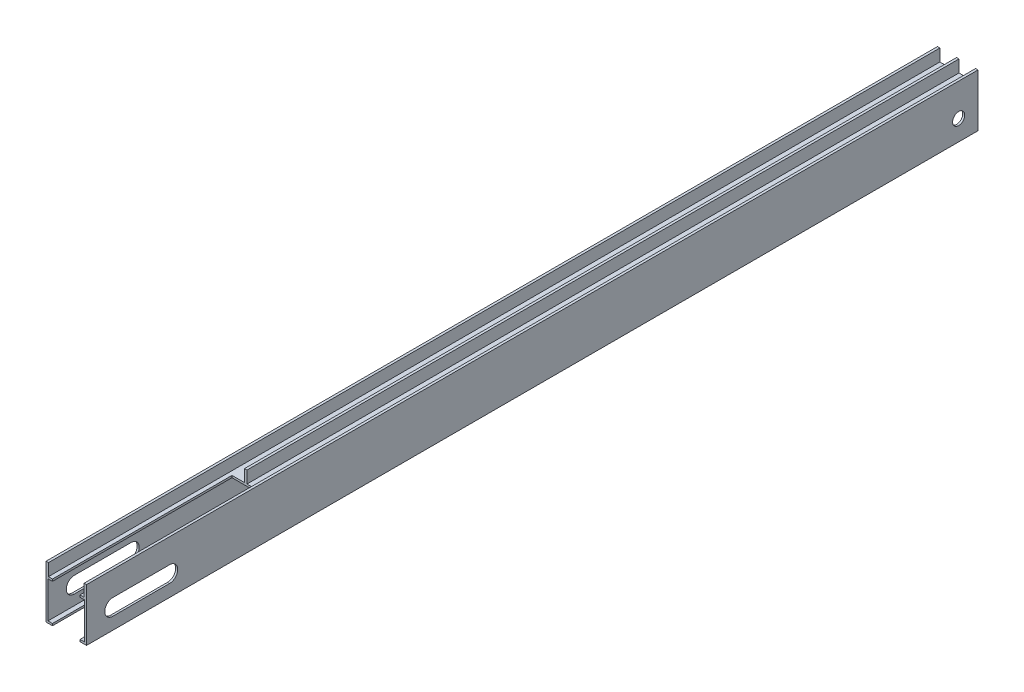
ISO-10303-21;
HEADER;
FILE_DESCRIPTION(('STEP AP214'),'2;1');
FILE_NAME('part.step','',(''),(''),'','','');
FILE_SCHEMA(('AUTOMOTIVE_DESIGN { 1 0 10303 214 1 1 1 1 }'));
ENDSEC;
DATA;
#1=APPLICATION_CONTEXT('core data for automotive mechanical design processes');
#2=APPLICATION_PROTOCOL_DEFINITION('international standard','automotive_design',2000,#1);
#3=PRODUCT_CONTEXT('',#1,'mechanical');
#4=PRODUCT('Part','Part','',(#3));
#5=PRODUCT_RELATED_PRODUCT_CATEGORY('part','',(#4));
#6=PRODUCT_DEFINITION_FORMATION('','',#4);
#7=PRODUCT_DEFINITION_CONTEXT('part definition',#1,'design');
#8=PRODUCT_DEFINITION('design','',#6,#7);
#9=PRODUCT_DEFINITION_SHAPE('','',#8);
#10=(LENGTH_UNIT() NAMED_UNIT(*) SI_UNIT(.MILLI.,.METRE.));
#11=(NAMED_UNIT(*) PLANE_ANGLE_UNIT() SI_UNIT($,.RADIAN.));
#12=(NAMED_UNIT(*) SI_UNIT($,.STERADIAN.) SOLID_ANGLE_UNIT());
#13=UNCERTAINTY_MEASURE_WITH_UNIT(LENGTH_MEASURE(1.E-05),#10,'distance_accuracy_value','');
#14=(GEOMETRIC_REPRESENTATION_CONTEXT(3) GLOBAL_UNCERTAINTY_ASSIGNED_CONTEXT((#13)) GLOBAL_UNIT_ASSIGNED_CONTEXT((#10,
#11,#12)) REPRESENTATION_CONTEXT('',''));
#15=CARTESIAN_POINT('',(0.,0.,0.));
#16=DIRECTION('',(0.,0.,1.));
#17=DIRECTION('',(1.,0.,0.));
#18=AXIS2_PLACEMENT_3D('',#15,#16,#17);
#19=CARTESIAN_POINT('',(50.,50.,2200.));
#20=DIRECTION('',(0.,-1.,0.));
#21=DIRECTION('',(1.,0.,0.));
#22=AXIS2_PLACEMENT_3D('',#19,#20,#21);
#23=PLANE('',#22);
#24=DIRECTION('',(-1.,0.,0.));
#25=VECTOR('',#24,1.);
#26=CARTESIAN_POINT('',(50.,50.,1757.));
#27=LINE('',#26,#25);
#28=CARTESIAN_POINT('',(-3.,50.,1757.));
#29=VERTEX_POINT('',#28);
#30=CARTESIAN_POINT('',(-34.,50.,1757.));
#31=VERTEX_POINT('',#30);
#32=EDGE_CURVE('E291',#29,#31,#27,.T.);
#33=ORIENTED_EDGE('',*,*,#32,.F.);
#34=DIRECTION('',(0.,0.,1.));
#35=VECTOR('',#34,1.);
#36=CARTESIAN_POINT('',(-3.,50.,-30.5941170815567));
#37=LINE('',#36,#35);
#38=CARTESIAN_POINT('',(-3.,50.,0.));
#39=VERTEX_POINT('',#38);
#40=EDGE_CURVE('E284',#39,#29,#37,.T.);
#41=ORIENTED_EDGE('',*,*,#40,.F.);
#42=DIRECTION('',(-1.,0.,0.));
#43=VECTOR('',#42,1.);
#44=CARTESIAN_POINT('',(50.,50.,0.));
#45=LINE('',#44,#43);
#46=CARTESIAN_POINT('',(-44.,50.,0.));
#47=VERTEX_POINT('',#46);
#48=EDGE_CURVE('E43',#39,#47,#45,.T.);
#49=ORIENTED_EDGE('',*,*,#48,.T.);
#50=DIRECTION('',(0.,0.,-1.));
#51=VECTOR('',#50,1.);
#52=CARTESIAN_POINT('',(-44.,50.,2200.));
#53=LINE('',#52,#51);
#54=CARTESIAN_POINT('',(-44.,50.,2200.));
#55=VERTEX_POINT('',#54);
#56=EDGE_CURVE('E398',#55,#47,#53,.T.);
#57=ORIENTED_EDGE('',*,*,#56,.F.);
#58=DIRECTION('',(-1.,0.,0.));
#59=VECTOR('',#58,1.);
#60=CARTESIAN_POINT('',(50.,50.,2200.));
#61=LINE('',#60,#59);
#62=CARTESIAN_POINT('',(-34.,50.,2200.));
#63=VERTEX_POINT('',#62);
#64=EDGE_CURVE('E447',#63,#55,#61,.T.);
#65=ORIENTED_EDGE('',*,*,#64,.F.);
#66=DIRECTION('',(0.,0.,-1.));
#67=VECTOR('',#66,1.);
#68=CARTESIAN_POINT('',(-34.,50.,2200.));
#69=LINE('',#68,#67);
#70=EDGE_CURVE('E309',#63,#31,#69,.T.);
#71=ORIENTED_EDGE('',*,*,#70,.T.);
#72=EDGE_LOOP('',(#33,#41,#49,#57,#65,#71));
#73=FACE_BOUND('',#72,.T.);
#74=ADVANCED_FACE('F39',(#73),#23,.F.);
#75=CARTESIAN_POINT('',(0.,0.,2200.));
#76=DIRECTION('',(0.,0.,1.));
#77=DIRECTION('',(1.,0.,0.));
#78=AXIS2_PLACEMENT_3D('',#75,#76,#77);
#79=PLANE('',#78);
#80=DIRECTION('',(0.,-1.,0.));
#81=VECTOR('',#80,1.);
#82=CARTESIAN_POINT('',(-34.,59.3201922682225,2200.));
#83=LINE('',#82,#81);
#84=CARTESIAN_POINT('',(-34.,45.,2200.));
#85=VERTEX_POINT('',#84);
#86=EDGE_CURVE('E582',#63,#85,#83,.T.);
#87=ORIENTED_EDGE('',*,*,#86,.F.);
#88=ORIENTED_EDGE('',*,*,#64,.T.);
#89=DIRECTION('',(0.,-1.,0.));
#90=VECTOR('',#89,1.);
#91=CARTESIAN_POINT('',(-44.,50.,2200.));
#92=LINE('',#91,#90);
#93=CARTESIAN_POINT('',(-44.,80.,2200.));
#94=VERTEX_POINT('',#93);
#95=EDGE_CURVE('E389',#94,#55,#92,.T.);
#96=ORIENTED_EDGE('',*,*,#95,.F.);
#97=DIRECTION('',(1.,0.,0.));
#98=VECTOR('',#97,1.);
#99=CARTESIAN_POINT('',(-44.,80.,2200.));
#100=LINE('',#99,#98);
#101=CARTESIAN_POINT('',(-50.,80.,2200.));
#102=VERTEX_POINT('',#101);
#103=EDGE_CURVE('E386',#102,#94,#100,.T.);
#104=ORIENTED_EDGE('',*,*,#103,.F.);
#105=DIRECTION('',(0.,-1.,0.));
#106=VECTOR('',#105,1.);
#107=CARTESIAN_POINT('',(-50.,-50.,2200.));
#108=LINE('',#107,#106);
#109=CARTESIAN_POINT('',(-50.,-50.,2200.));
#110=VERTEX_POINT('',#109);
#111=EDGE_CURVE('E514',#102,#110,#108,.T.);
#112=ORIENTED_EDGE('',*,*,#111,.T.);
#113=DIRECTION('',(1.,0.,0.));
#114=VECTOR('',#113,1.);
#115=CARTESIAN_POINT('',(50.,-50.,2200.));
#116=LINE('',#115,#114);
#117=CARTESIAN_POINT('',(-34.,-50.,2200.));
#118=VERTEX_POINT('',#117);
#119=EDGE_CURVE('E517',#110,#118,#116,.T.);
#120=ORIENTED_EDGE('',*,*,#119,.T.);
#121=CARTESIAN_POINT('',(-34.,-45.,2200.));
#122=VERTEX_POINT('',#121);
#123=EDGE_CURVE('E575',#122,#118,#83,.T.);
#124=ORIENTED_EDGE('',*,*,#123,.F.);
#125=DIRECTION('',(1.,0.,0.));
#126=VECTOR('',#125,1.);
#127=CARTESIAN_POINT('',(45.,-45.,2200.));
#128=LINE('',#127,#126);
#129=CARTESIAN_POINT('',(-45.,-45.,2200.));
#130=VERTEX_POINT('',#129);
#131=EDGE_CURVE('E495',#130,#122,#128,.T.);
#132=ORIENTED_EDGE('',*,*,#131,.F.);
#133=DIRECTION('',(0.,-1.,0.));
#134=VECTOR('',#133,1.);
#135=CARTESIAN_POINT('',(-45.,-45.,2200.));
#136=LINE('',#135,#134);
#137=CARTESIAN_POINT('',(-45.,45.,2200.));
#138=VERTEX_POINT('',#137);
#139=EDGE_CURVE('E491',#138,#130,#136,.T.);
#140=ORIENTED_EDGE('',*,*,#139,.F.);
#141=DIRECTION('',(-1.,0.,0.));
#142=VECTOR('',#141,1.);
#143=CARTESIAN_POINT('',(45.,45.,2200.));
#144=LINE('',#143,#142);
#145=EDGE_CURVE('E487',#85,#138,#144,.T.);
#146=ORIENTED_EDGE('',*,*,#145,.F.);
#147=EDGE_LOOP('',(#87,#88,#96,#104,#112,#120,#124,#132,#140,#146));
#148=FACE_BOUND('',#147,.T.);
#149=ADVANCED_FACE('F574',(#148),#79,.T.);
#150=CARTESIAN_POINT('',(45.,-45.,2200.));
#151=DIRECTION('',(0.,1.,0.));
#152=DIRECTION('',(-1.,0.,0.));
#153=AXIS2_PLACEMENT_3D('',#150,#151,#152);
#154=PLANE('',#153);
#155=DIRECTION('',(0.,0.,1.));
#156=VECTOR('',#155,1.);
#157=CARTESIAN_POINT('',(-34.,-45.,2200.));
#158=LINE('',#157,#156);
#159=CARTESIAN_POINT('',(-34.,-45.,1757.));
#160=VERTEX_POINT('',#159);
#161=EDGE_CURVE('E315',#160,#122,#158,.T.);
#162=ORIENTED_EDGE('',*,*,#161,.F.);
#163=DIRECTION('',(1.,0.,0.));
#164=VECTOR('',#163,1.);
#165=CARTESIAN_POINT('',(45.,-45.,1757.));
#166=LINE('',#165,#164);
#167=CARTESIAN_POINT('',(34.,-45.,1757.));
#168=VERTEX_POINT('',#167);
#169=EDGE_CURVE('E293',#160,#168,#166,.T.);
#170=ORIENTED_EDGE('',*,*,#169,.T.);
#171=DIRECTION('',(0.,0.,-1.));
#172=VECTOR('',#171,1.);
#173=CARTESIAN_POINT('',(34.,-45.,2200.));
#174=LINE('',#173,#172);
#175=CARTESIAN_POINT('',(34.,-45.,2200.));
#176=VERTEX_POINT('',#175);
#177=EDGE_CURVE('E307',#176,#168,#174,.T.);
#178=ORIENTED_EDGE('',*,*,#177,.F.);
#179=CARTESIAN_POINT('',(45.,-45.,2200.));
#180=VERTEX_POINT('',#179);
#181=EDGE_CURVE('E494',#176,#180,#128,.T.);
#182=ORIENTED_EDGE('',*,*,#181,.T.);
#183=DIRECTION('',(0.,0.,-1.));
#184=VECTOR('',#183,1.);
#185=CARTESIAN_POINT('',(45.,-45.,2200.));
#186=LINE('',#185,#184);
#187=CARTESIAN_POINT('',(45.,-45.,103.));
#188=VERTEX_POINT('',#187);
#189=EDGE_CURVE('E498',#180,#188,#186,.T.);
#190=ORIENTED_EDGE('',*,*,#189,.T.);
#191=DIRECTION('',(-1.,0.,0.));
#192=VECTOR('',#191,1.);
#193=CARTESIAN_POINT('',(45.,-45.,103.));
#194=LINE('',#193,#192);
#195=CARTESIAN_POINT('',(-45.,-45.,103.));
#196=VERTEX_POINT('',#195);
#197=EDGE_CURVE('E429',#188,#196,#194,.T.);
#198=ORIENTED_EDGE('',*,*,#197,.T.);
#199=DIRECTION('',(0.,0.,-1.));
#200=VECTOR('',#199,1.);
#201=CARTESIAN_POINT('',(-45.,-45.,2200.));
#202=LINE('',#201,#200);
#203=EDGE_CURVE('E506',#130,#196,#202,.T.);
#204=ORIENTED_EDGE('',*,*,#203,.F.);
#205=ORIENTED_EDGE('',*,*,#131,.T.);
#206=EDGE_LOOP('',(#162,#170,#178,#182,#190,#198,#204,#205));
#207=FACE_BOUND('',#206,.T.);
#208=ADVANCED_FACE('F563',(#207),#154,.T.);
#209=DIRECTION('',(0.,1.,0.));
#210=VECTOR('',#209,1.);
#211=CARTESIAN_POINT('',(34.,59.3201922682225,2200.));
#212=LINE('',#211,#210);
#213=CARTESIAN_POINT('',(34.,-50.,2200.));
#214=VERTEX_POINT('',#213);
#215=EDGE_CURVE('E524',#214,#176,#212,.T.);
#216=ORIENTED_EDGE('',*,*,#215,.F.);
#217=CARTESIAN_POINT('',(50.,-50.,2200.));
#218=VERTEX_POINT('',#217);
#219=EDGE_CURVE('E516',#214,#218,#116,.T.);
#220=ORIENTED_EDGE('',*,*,#219,.T.);
#221=DIRECTION('',(0.,1.,0.));
#222=VECTOR('',#221,1.);
#223=CARTESIAN_POINT('',(50.,-50.,2200.));
#224=LINE('',#223,#222);
#225=CARTESIAN_POINT('',(50.,80.,2200.));
#226=VERTEX_POINT('',#225);
#227=EDGE_CURVE('E450',#218,#226,#224,.T.);
#228=ORIENTED_EDGE('',*,*,#227,.T.);
#229=DIRECTION('',(1.,0.,0.));
#230=VECTOR('',#229,1.);
#231=CARTESIAN_POINT('',(50.,80.,2200.));
#232=LINE('',#231,#230);
#233=CARTESIAN_POINT('',(44.,80.,2200.));
#234=VERTEX_POINT('',#233);
#235=EDGE_CURVE('E406',#234,#226,#232,.T.);
#236=ORIENTED_EDGE('',*,*,#235,.F.);
#237=DIRECTION('',(0.,1.,0.));
#238=VECTOR('',#237,1.);
#239=CARTESIAN_POINT('',(44.,50.,2200.));
#240=LINE('',#239,#238);
#241=CARTESIAN_POINT('',(44.,50.,2200.));
#242=VERTEX_POINT('',#241);
#243=EDGE_CURVE('E410',#242,#234,#240,.T.);
#244=ORIENTED_EDGE('',*,*,#243,.F.);
#245=CARTESIAN_POINT('',(34.,50.,2200.));
#246=VERTEX_POINT('',#245);
#247=EDGE_CURVE('E449',#242,#246,#61,.T.);
#248=ORIENTED_EDGE('',*,*,#247,.T.);
#249=CARTESIAN_POINT('',(34.,45.,2200.));
#250=VERTEX_POINT('',#249);
#251=EDGE_CURVE('E297',#250,#246,#212,.T.);
#252=ORIENTED_EDGE('',*,*,#251,.F.);
#253=CARTESIAN_POINT('',(45.,45.,2200.));
#254=VERTEX_POINT('',#253);
#255=EDGE_CURVE('E489',#254,#250,#144,.T.);
#256=ORIENTED_EDGE('',*,*,#255,.F.);
#257=DIRECTION('',(0.,1.,0.));
#258=VECTOR('',#257,1.);
#259=CARTESIAN_POINT('',(45.,-45.,2200.));
#260=LINE('',#259,#258);
#261=EDGE_CURVE('E485',#180,#254,#260,.T.);
#262=ORIENTED_EDGE('',*,*,#261,.F.);
#263=ORIENTED_EDGE('',*,*,#181,.F.);
#264=EDGE_LOOP('',(#216,#220,#228,#236,#244,#248,#252,#256,#262,#263));
#265=FACE_BOUND('',#264,.T.);
#266=ADVANCED_FACE('F475',(#265),#79,.T.);
#267=CARTESIAN_POINT('',(0.,0.,0.));
#268=DIRECTION('',(0.,0.,1.));
#269=DIRECTION('',(1.,0.,0.));
#270=AXIS2_PLACEMENT_3D('',#267,#268,#269);
#271=PLANE('',#270);
#272=DIRECTION('',(0.,-1.,0.));
#273=VECTOR('',#272,1.);
#274=CARTESIAN_POINT('',(-45.,-45.,0.));
#275=LINE('',#274,#273);
#276=CARTESIAN_POINT('',(-45.,45.,0.));
#277=VERTEX_POINT('',#276);
#278=CARTESIAN_POINT('',(-45.,-50.,0.));
#279=VERTEX_POINT('',#278);
#280=EDGE_CURVE('E488',#277,#279,#275,.T.);
#281=ORIENTED_EDGE('',*,*,#280,.T.);
#282=DIRECTION('',(1.,0.,0.));
#283=VECTOR('',#282,1.);
#284=CARTESIAN_POINT('',(50.,-50.,0.));
#285=LINE('',#284,#283);
#286=CARTESIAN_POINT('',(-50.,-50.,0.));
#287=VERTEX_POINT('',#286);
#288=EDGE_CURVE('E535',#287,#279,#285,.T.);
#289=ORIENTED_EDGE('',*,*,#288,.F.);
#290=DIRECTION('',(0.,-1.,0.));
#291=VECTOR('',#290,1.);
#292=CARTESIAN_POINT('',(-50.,-50.,0.));
#293=LINE('',#292,#291);
#294=CARTESIAN_POINT('',(-50.,80.,0.));
#295=VERTEX_POINT('',#294);
#296=EDGE_CURVE('E455',#295,#287,#293,.T.);
#297=ORIENTED_EDGE('',*,*,#296,.F.);
#298=DIRECTION('',(1.,0.,0.));
#299=VECTOR('',#298,1.);
#300=CARTESIAN_POINT('',(-44.,80.,0.));
#301=LINE('',#300,#299);
#302=CARTESIAN_POINT('',(-44.,80.,0.));
#303=VERTEX_POINT('',#302);
#304=EDGE_CURVE('E385',#295,#303,#301,.T.);
#305=ORIENTED_EDGE('',*,*,#304,.T.);
#306=DIRECTION('',(0.,-1.,0.));
#307=VECTOR('',#306,1.);
#308=CARTESIAN_POINT('',(-44.,50.,0.));
#309=LINE('',#308,#307);
#310=EDGE_CURVE('E390',#303,#47,#309,.T.);
#311=ORIENTED_EDGE('',*,*,#310,.T.);
#312=ORIENTED_EDGE('',*,*,#48,.F.);
#313=DIRECTION('',(0.,1.,0.));
#314=VECTOR('',#313,1.);
#315=CARTESIAN_POINT('',(-3.,50.,0.));
#316=LINE('',#315,#314);
#317=CARTESIAN_POINT('',(-3.00000000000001,80.,0.));
#318=VERTEX_POINT('',#317);
#319=EDGE_CURVE('E583',#39,#318,#316,.T.);
#320=ORIENTED_EDGE('',*,*,#319,.T.);
#321=DIRECTION('',(1.,0.,0.));
#322=VECTOR('',#321,1.);
#323=CARTESIAN_POINT('',(-3.00000000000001,80.,0.));
#324=LINE('',#323,#322);
#325=CARTESIAN_POINT('',(3.,80.,0.));
#326=VERTEX_POINT('',#325);
#327=EDGE_CURVE('E584',#318,#326,#324,.T.);
#328=ORIENTED_EDGE('',*,*,#327,.T.);
#329=DIRECTION('',(0.,-1.,0.));
#330=VECTOR('',#329,1.);
#331=CARTESIAN_POINT('',(3.,50.,0.));
#332=LINE('',#331,#330);
#333=CARTESIAN_POINT('',(3.,50.,0.));
#334=VERTEX_POINT('',#333);
#335=EDGE_CURVE('E588',#326,#334,#332,.T.);
#336=ORIENTED_EDGE('',*,*,#335,.T.);
#337=CARTESIAN_POINT('',(44.,50.,0.));
#338=VERTEX_POINT('',#337);
#339=EDGE_CURVE('E283',#338,#334,#45,.T.);
#340=ORIENTED_EDGE('',*,*,#339,.F.);
#341=DIRECTION('',(0.,1.,0.));
#342=VECTOR('',#341,1.);
#343=CARTESIAN_POINT('',(44.,50.,0.));
#344=LINE('',#343,#342);
#345=CARTESIAN_POINT('',(44.,80.,0.));
#346=VERTEX_POINT('',#345);
#347=EDGE_CURVE('E401',#338,#346,#344,.T.);
#348=ORIENTED_EDGE('',*,*,#347,.T.);
#349=DIRECTION('',(1.,0.,0.));
#350=VECTOR('',#349,1.);
#351=CARTESIAN_POINT('',(50.,80.,0.));
#352=LINE('',#351,#350);
#353=CARTESIAN_POINT('',(50.,80.,0.));
#354=VERTEX_POINT('',#353);
#355=EDGE_CURVE('E411',#346,#354,#352,.T.);
#356=ORIENTED_EDGE('',*,*,#355,.T.);
#357=DIRECTION('',(0.,1.,0.));
#358=VECTOR('',#357,1.);
#359=CARTESIAN_POINT('',(50.,-50.,0.));
#360=LINE('',#359,#358);
#361=CARTESIAN_POINT('',(50.,-50.,0.));
#362=VERTEX_POINT('',#361);
#363=EDGE_CURVE('E534',#362,#354,#360,.T.);
#364=ORIENTED_EDGE('',*,*,#363,.F.);
#365=CARTESIAN_POINT('',(45.,-50.,0.));
#366=VERTEX_POINT('',#365);
#367=EDGE_CURVE('E530',#366,#362,#285,.T.);
#368=ORIENTED_EDGE('',*,*,#367,.F.);
#369=DIRECTION('',(0.,1.,0.));
#370=VECTOR('',#369,1.);
#371=CARTESIAN_POINT('',(45.,-45.,0.));
#372=LINE('',#371,#370);
#373=CARTESIAN_POINT('',(45.,45.,0.));
#374=VERTEX_POINT('',#373);
#375=EDGE_CURVE('E422',#366,#374,#372,.T.);
#376=ORIENTED_EDGE('',*,*,#375,.T.);
#377=DIRECTION('',(-1.,0.,0.));
#378=VECTOR('',#377,1.);
#379=CARTESIAN_POINT('',(45.,45.,0.));
#380=LINE('',#379,#378);
#381=EDGE_CURVE('E500',#374,#277,#380,.T.);
#382=ORIENTED_EDGE('',*,*,#381,.T.);
#383=EDGE_LOOP('',(#281,#289,#297,#305,#311,#312,#320,#328,#336,#340,#348,#356,#364,#368,#376,#382));
#384=FACE_BOUND('',#383,.T.);
#385=ADVANCED_FACE('F465',(#384),#271,.F.);
#386=CARTESIAN_POINT('',(-50.,-50.,2200.));
#387=DIRECTION('',(1.,0.,0.));
#388=DIRECTION('',(0.,0.,-1.));
#389=AXIS2_PLACEMENT_3D('',#386,#387,#388);
#390=PLANE('',#389);
#391=DIRECTION('',(0.,0.,1.));
#392=VECTOR('',#391,1.);
#393=CARTESIAN_POINT('',(-50.,20.,2200.));
#394=LINE('',#393,#392);
#395=CARTESIAN_POINT('',(-50.,20.,1995.));
#396=VERTEX_POINT('',#395);
#397=CARTESIAN_POINT('',(-50.,20.,2135.));
#398=VERTEX_POINT('',#397);
#399=EDGE_CURVE('E354',#396,#398,#394,.T.);
#400=ORIENTED_EDGE('',*,*,#399,.T.);
#401=CARTESIAN_POINT('',(-50.,0.,2135.));
#402=DIRECTION('',(1.,0.,0.));
#403=DIRECTION('',(0.,0.,-1.));
#404=AXIS2_PLACEMENT_3D('',#401,#402,#403);
#405=CIRCLE('',#404,20.);
#406=CARTESIAN_POINT('',(-50.,-20.,2135.));
#407=VERTEX_POINT('',#406);
#408=EDGE_CURVE('E359',#398,#407,#405,.T.);
#409=ORIENTED_EDGE('',*,*,#408,.T.);
#410=DIRECTION('',(0.,0.,-1.));
#411=VECTOR('',#410,1.);
#412=CARTESIAN_POINT('',(-50.,-20.,2200.));
#413=LINE('',#412,#411);
#414=CARTESIAN_POINT('',(-50.,-20.,1995.));
#415=VERTEX_POINT('',#414);
#416=EDGE_CURVE('E343',#407,#415,#413,.T.);
#417=ORIENTED_EDGE('',*,*,#416,.T.);
#418=CARTESIAN_POINT('',(-50.,0.,1995.));
#419=DIRECTION('',(1.,0.,0.));
#420=DIRECTION('',(0.,0.,-1.));
#421=AXIS2_PLACEMENT_3D('',#418,#419,#420);
#422=CIRCLE('',#421,20.);
#423=EDGE_CURVE('E349',#415,#396,#422,.T.);
#424=ORIENTED_EDGE('',*,*,#423,.T.);
#425=EDGE_LOOP('',(#400,#409,#417,#424));
#426=FACE_BOUND('',#425,.T.);
#427=CARTESIAN_POINT('',(-50.,0.,47.6969600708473));
#428=DIRECTION('',(1.,0.,0.));
#429=DIRECTION('',(0.,0.,-1.));
#430=AXIS2_PLACEMENT_3D('',#427,#428,#429);
#431=CIRCLE('',#430,15.);
#432=CARTESIAN_POINT('',(-50.,0.,32.6969600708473));
#433=VERTEX_POINT('',#432);
#434=EDGE_CURVE('E369',#433,#433,#431,.T.);
#435=ORIENTED_EDGE('',*,*,#434,.T.);
#436=EDGE_LOOP('',(#435));
#437=FACE_BOUND('',#436,.T.);
#438=ORIENTED_EDGE('',*,*,#296,.T.);
#439=DIRECTION('',(0.,0.,-1.));
#440=VECTOR('',#439,1.);
#441=CARTESIAN_POINT('',(-50.,-50.,2200.));
#442=LINE('',#441,#440);
#443=EDGE_CURVE('E433',#110,#287,#442,.T.);
#444=ORIENTED_EDGE('',*,*,#443,.F.);
#445=ORIENTED_EDGE('',*,*,#111,.F.);
#446=DIRECTION('',(0.,0.,-1.));
#447=VECTOR('',#446,1.);
#448=CARTESIAN_POINT('',(-50.,80.,2200.));
#449=LINE('',#448,#447);
#450=EDGE_CURVE('E393',#102,#295,#449,.T.);
#451=ORIENTED_EDGE('',*,*,#450,.T.);
#452=EDGE_LOOP('',(#438,#444,#445,#451));
#453=FACE_BOUND('',#452,.T.);
#454=ADVANCED_FACE('F41',(#426,#437,#453),#390,.F.);
#455=CARTESIAN_POINT('',(50.,-50.,2200.));
#456=DIRECTION('',(0.,1.,0.));
#457=DIRECTION('',(-1.,0.,0.));
#458=AXIS2_PLACEMENT_3D('',#455,#456,#457);
#459=PLANE('',#458);
#460=DIRECTION('',(1.,0.,0.));
#461=VECTOR('',#460,1.);
#462=CARTESIAN_POINT('',(50.,-50.,1757.));
#463=LINE('',#462,#461);
#464=CARTESIAN_POINT('',(-34.,-50.,1757.));
#465=VERTEX_POINT('',#464);
#466=CARTESIAN_POINT('',(34.,-50.,1757.));
#467=VERTEX_POINT('',#466);
#468=EDGE_CURVE('E290',#465,#467,#463,.T.);
#469=ORIENTED_EDGE('',*,*,#468,.F.);
#470=DIRECTION('',(0.,0.,1.));
#471=VECTOR('',#470,1.);
#472=CARTESIAN_POINT('',(-34.,-50.,2200.));
#473=LINE('',#472,#471);
#474=EDGE_CURVE('E312',#465,#118,#473,.T.);
#475=ORIENTED_EDGE('',*,*,#474,.T.);
#476=ORIENTED_EDGE('',*,*,#119,.F.);
#477=ORIENTED_EDGE('',*,*,#443,.T.);
#478=ORIENTED_EDGE('',*,*,#288,.T.);
#479=DIRECTION('',(0.,0.,1.));
#480=VECTOR('',#479,1.);
#481=CARTESIAN_POINT('',(-45.,-50.,2200.));
#482=LINE('',#481,#480);
#483=CARTESIAN_POINT('',(-45.,-50.,103.));
#484=VERTEX_POINT('',#483);
#485=EDGE_CURVE('E382',#279,#484,#482,.T.);
#486=ORIENTED_EDGE('',*,*,#485,.T.);
#487=DIRECTION('',(-1.,0.,0.));
#488=VECTOR('',#487,1.);
#489=CARTESIAN_POINT('',(50.,-50.,103.));
#490=LINE('',#489,#488);
#491=CARTESIAN_POINT('',(45.,-50.,103.));
#492=VERTEX_POINT('',#491);
#493=EDGE_CURVE('E377',#492,#484,#490,.T.);
#494=ORIENTED_EDGE('',*,*,#493,.F.);
#495=DIRECTION('',(0.,0.,-1.));
#496=VECTOR('',#495,1.);
#497=CARTESIAN_POINT('',(45.,-50.,2200.));
#498=LINE('',#497,#496);
#499=EDGE_CURVE('E379',#492,#366,#498,.T.);
#500=ORIENTED_EDGE('',*,*,#499,.T.);
#501=ORIENTED_EDGE('',*,*,#367,.T.);
#502=DIRECTION('',(0.,0.,-1.));
#503=VECTOR('',#502,1.);
#504=CARTESIAN_POINT('',(50.,-50.,2200.));
#505=LINE('',#504,#503);
#506=EDGE_CURVE('E461',#218,#362,#505,.T.);
#507=ORIENTED_EDGE('',*,*,#506,.F.);
#508=ORIENTED_EDGE('',*,*,#219,.F.);
#509=DIRECTION('',(0.,0.,-1.));
#510=VECTOR('',#509,1.);
#511=CARTESIAN_POINT('',(34.,-50.,2200.));
#512=LINE('',#511,#510);
#513=EDGE_CURVE('E304',#214,#467,#512,.T.);
#514=ORIENTED_EDGE('',*,*,#513,.T.);
#515=EDGE_LOOP('',(#469,#475,#476,#477,#478,#486,#494,#500,#501,#507,#508,#514));
#516=FACE_BOUND('',#515,.T.);
#517=ADVANCED_FACE('F528',(#516),#459,.F.);
#518=CARTESIAN_POINT('',(50.,-50.,2200.));
#519=DIRECTION('',(-1.,0.,0.));
#520=DIRECTION('',(0.,0.,1.));
#521=AXIS2_PLACEMENT_3D('',#518,#519,#520);
#522=PLANE('',#521);
#523=DIRECTION('',(0.,0.,-1.));
#524=VECTOR('',#523,1.);
#525=CARTESIAN_POINT('',(50.,-20.,2135.));
#526=LINE('',#525,#524);
#527=CARTESIAN_POINT('',(50.,-20.,2135.));
#528=VERTEX_POINT('',#527);
#529=CARTESIAN_POINT('',(50.,-20.,1995.));
#530=VERTEX_POINT('',#529);
#531=EDGE_CURVE('E319',#528,#530,#526,.T.);
#532=ORIENTED_EDGE('',*,*,#531,.F.);
#533=CARTESIAN_POINT('',(50.,0.,2135.));
#534=DIRECTION('',(1.,0.,0.));
#535=DIRECTION('',(0.,0.,-1.));
#536=AXIS2_PLACEMENT_3D('',#533,#534,#535);
#537=CIRCLE('',#536,20.);
#538=CARTESIAN_POINT('',(50.,20.,2135.));
#539=VERTEX_POINT('',#538);
#540=EDGE_CURVE('E317',#539,#528,#537,.T.);
#541=ORIENTED_EDGE('',*,*,#540,.F.);
#542=DIRECTION('',(0.,0.,1.));
#543=VECTOR('',#542,1.);
#544=CARTESIAN_POINT('',(50.,20.,2135.));
#545=LINE('',#544,#543);
#546=CARTESIAN_POINT('',(50.,20.,1995.));
#547=VERTEX_POINT('',#546);
#548=EDGE_CURVE('E325',#547,#539,#545,.T.);
#549=ORIENTED_EDGE('',*,*,#548,.F.);
#550=CARTESIAN_POINT('',(50.,0.,1995.));
#551=DIRECTION('',(1.,0.,0.));
#552=DIRECTION('',(0.,0.,-1.));
#553=AXIS2_PLACEMENT_3D('',#550,#551,#552);
#554=CIRCLE('',#553,20.);
#555=EDGE_CURVE('E322',#530,#547,#554,.T.);
#556=ORIENTED_EDGE('',*,*,#555,.F.);
#557=EDGE_LOOP('',(#532,#541,#549,#556));
#558=FACE_BOUND('',#557,.T.);
#559=CARTESIAN_POINT('',(50.,0.,47.6969600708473));
#560=DIRECTION('',(1.,0.,0.));
#561=DIRECTION('',(0.,0.,-1.));
#562=AXIS2_PLACEMENT_3D('',#559,#560,#561);
#563=CIRCLE('',#562,15.);
#564=CARTESIAN_POINT('',(50.,0.,32.6969600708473));
#565=VERTEX_POINT('',#564);
#566=EDGE_CURVE('E362',#565,#565,#563,.T.);
#567=ORIENTED_EDGE('',*,*,#566,.F.);
#568=EDGE_LOOP('',(#567));
#569=FACE_BOUND('',#568,.T.);
#570=ORIENTED_EDGE('',*,*,#363,.T.);
#571=DIRECTION('',(0.,0.,-1.));
#572=VECTOR('',#571,1.);
#573=CARTESIAN_POINT('',(50.,80.,2200.));
#574=LINE('',#573,#572);
#575=EDGE_CURVE('E416',#226,#354,#574,.T.);
#576=ORIENTED_EDGE('',*,*,#575,.F.);
#577=ORIENTED_EDGE('',*,*,#227,.F.);
#578=ORIENTED_EDGE('',*,*,#506,.T.);
#579=EDGE_LOOP('',(#570,#576,#577,#578));
#580=FACE_BOUND('',#579,.T.);
#581=ADVANCED_FACE('F533',(#558,#569,#580),#522,.F.);
#582=ORIENTED_EDGE('',*,*,#339,.T.);
#583=DIRECTION('',(0.,0.,1.));
#584=VECTOR('',#583,1.);
#585=CARTESIAN_POINT('',(3.,50.,-30.5941170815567));
#586=LINE('',#585,#584);
#587=CARTESIAN_POINT('',(3.,50.,1757.));
#588=VERTEX_POINT('',#587);
#589=EDGE_CURVE('E268',#334,#588,#586,.T.);
#590=ORIENTED_EDGE('',*,*,#589,.T.);
#591=CARTESIAN_POINT('',(34.,50.,1757.));
#592=VERTEX_POINT('',#591);
#593=EDGE_CURVE('E280',#592,#588,#27,.T.);
#594=ORIENTED_EDGE('',*,*,#593,.F.);
#595=DIRECTION('',(0.,0.,1.));
#596=VECTOR('',#595,1.);
#597=CARTESIAN_POINT('',(34.,50.,2200.));
#598=LINE('',#597,#596);
#599=EDGE_CURVE('E302',#592,#246,#598,.T.);
#600=ORIENTED_EDGE('',*,*,#599,.T.);
#601=ORIENTED_EDGE('',*,*,#247,.F.);
#602=DIRECTION('',(0.,0.,-1.));
#603=VECTOR('',#602,1.);
#604=CARTESIAN_POINT('',(44.,50.,2200.));
#605=LINE('',#604,#603);
#606=EDGE_CURVE('E419',#242,#338,#605,.T.);
#607=ORIENTED_EDGE('',*,*,#606,.T.);
#608=EDGE_LOOP('',(#582,#590,#594,#600,#601,#607));
#609=FACE_BOUND('',#608,.T.);
#610=ADVANCED_FACE('F278',(#609),#23,.F.);
#611=CARTESIAN_POINT('',(45.,-45.,2200.));
#612=DIRECTION('',(-1.,0.,0.));
#613=DIRECTION('',(0.,0.,1.));
#614=AXIS2_PLACEMENT_3D('',#611,#612,#613);
#615=PLANE('',#614);
#616=CARTESIAN_POINT('',(45.,0.,2135.));
#617=DIRECTION('',(-1.,0.,0.));
#618=DIRECTION('',(0.,0.,1.));
#619=AXIS2_PLACEMENT_3D('',#616,#617,#618);
#620=CIRCLE('',#619,20.);
#621=CARTESIAN_POINT('',(45.,-20.,2135.));
#622=VERTEX_POINT('',#621);
#623=CARTESIAN_POINT('',(45.,20.,2135.));
#624=VERTEX_POINT('',#623);
#625=EDGE_CURVE('E357',#622,#624,#620,.T.);
#626=ORIENTED_EDGE('',*,*,#625,.F.);
#627=DIRECTION('',(0.,0.,1.));
#628=VECTOR('',#627,1.);
#629=CARTESIAN_POINT('',(45.,-20.,2200.));
#630=LINE('',#629,#628);
#631=CARTESIAN_POINT('',(45.,-20.,1995.));
#632=VERTEX_POINT('',#631);
#633=EDGE_CURVE('E341',#632,#622,#630,.T.);
#634=ORIENTED_EDGE('',*,*,#633,.F.);
#635=CARTESIAN_POINT('',(45.,0.,1995.));
#636=DIRECTION('',(-1.,0.,0.));
#637=DIRECTION('',(0.,0.,1.));
#638=AXIS2_PLACEMENT_3D('',#635,#636,#637);
#639=CIRCLE('',#638,20.);
#640=CARTESIAN_POINT('',(45.,20.,1995.));
#641=VERTEX_POINT('',#640);
#642=EDGE_CURVE('E346',#641,#632,#639,.T.);
#643=ORIENTED_EDGE('',*,*,#642,.F.);
#644=DIRECTION('',(0.,0.,-1.));
#645=VECTOR('',#644,1.);
#646=CARTESIAN_POINT('',(45.,20.,2200.));
#647=LINE('',#646,#645);
#648=EDGE_CURVE('E352',#624,#641,#647,.T.);
#649=ORIENTED_EDGE('',*,*,#648,.F.);
#650=EDGE_LOOP('',(#626,#634,#643,#649));
#651=FACE_BOUND('',#650,.T.);
#652=CARTESIAN_POINT('',(45.,0.,47.6969600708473));
#653=DIRECTION('',(-1.,0.,0.));
#654=DIRECTION('',(0.,0.,1.));
#655=AXIS2_PLACEMENT_3D('',#652,#653,#654);
#656=CIRCLE('',#655,15.);
#657=CARTESIAN_POINT('',(45.,0.,62.6969600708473));
#658=VERTEX_POINT('',#657);
#659=EDGE_CURVE('E366',#658,#658,#656,.T.);
#660=ORIENTED_EDGE('',*,*,#659,.F.);
#661=EDGE_LOOP('',(#660));
#662=FACE_BOUND('',#661,.T.);
#663=DIRECTION('',(0.,0.,-1.));
#664=VECTOR('',#663,1.);
#665=CARTESIAN_POINT('',(45.,45.,2200.));
#666=LINE('',#665,#664);
#667=EDGE_CURVE('E511',#254,#374,#666,.T.);
#668=ORIENTED_EDGE('',*,*,#667,.T.);
#669=ORIENTED_EDGE('',*,*,#375,.F.);
#670=ORIENTED_EDGE('',*,*,#499,.F.);
#671=DIRECTION('',(0.,-1.,0.));
#672=VECTOR('',#671,1.);
#673=CARTESIAN_POINT('',(45.,-17.3056175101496,103.));
#674=LINE('',#673,#672);
#675=EDGE_CURVE('E374',#188,#492,#674,.T.);
#676=ORIENTED_EDGE('',*,*,#675,.F.);
#677=ORIENTED_EDGE('',*,*,#189,.F.);
#678=ORIENTED_EDGE('',*,*,#261,.T.);
#679=EDGE_LOOP('',(#668,#669,#670,#676,#677,#678));
#680=FACE_BOUND('',#679,.T.);
#681=ADVANCED_FACE('F559',(#651,#662,#680),#615,.T.);
#682=CARTESIAN_POINT('',(45.,45.,2200.));
#683=DIRECTION('',(0.,-1.,0.));
#684=DIRECTION('',(1.,0.,0.));
#685=AXIS2_PLACEMENT_3D('',#682,#683,#684);
#686=PLANE('',#685);
#687=DIRECTION('',(0.,0.,-1.));
#688=VECTOR('',#687,1.);
#689=CARTESIAN_POINT('',(-34.,45.,2200.));
#690=LINE('',#689,#688);
#691=CARTESIAN_POINT('',(-34.,45.,1757.));
#692=VERTEX_POINT('',#691);
#693=EDGE_CURVE('E12',#85,#692,#690,.T.);
#694=ORIENTED_EDGE('',*,*,#693,.F.);
#695=ORIENTED_EDGE('',*,*,#145,.T.);
#696=DIRECTION('',(0.,0.,-1.));
#697=VECTOR('',#696,1.);
#698=CARTESIAN_POINT('',(-45.,45.,2200.));
#699=LINE('',#698,#697);
#700=EDGE_CURVE('E509',#138,#277,#699,.T.);
#701=ORIENTED_EDGE('',*,*,#700,.T.);
#702=ORIENTED_EDGE('',*,*,#381,.F.);
#703=ORIENTED_EDGE('',*,*,#667,.F.);
#704=ORIENTED_EDGE('',*,*,#255,.T.);
#705=DIRECTION('',(0.,0.,1.));
#706=VECTOR('',#705,1.);
#707=CARTESIAN_POINT('',(34.,45.,2200.));
#708=LINE('',#707,#706);
#709=CARTESIAN_POINT('',(34.,45.,1757.));
#710=VERTEX_POINT('',#709);
#711=EDGE_CURVE('E49',#710,#250,#708,.T.);
#712=ORIENTED_EDGE('',*,*,#711,.F.);
#713=DIRECTION('',(-1.,0.,0.));
#714=VECTOR('',#713,1.);
#715=CARTESIAN_POINT('',(45.,45.,1757.));
#716=LINE('',#715,#714);
#717=EDGE_CURVE('E444',#710,#692,#716,.T.);
#718=ORIENTED_EDGE('',*,*,#717,.T.);
#719=EDGE_LOOP('',(#694,#695,#701,#702,#703,#704,#712,#718));
#720=FACE_BOUND('',#719,.T.);
#721=ADVANCED_FACE('F568',(#720),#686,.T.);
#722=CARTESIAN_POINT('',(-45.,-45.,2200.));
#723=DIRECTION('',(1.,0.,0.));
#724=DIRECTION('',(0.,1.,0.));
#725=AXIS2_PLACEMENT_3D('',#722,#723,#724);
#726=PLANE('',#725);
#727=CARTESIAN_POINT('',(-45.,0.,2135.));
#728=DIRECTION('',(1.,0.,0.));
#729=DIRECTION('',(0.,1.,0.));
#730=AXIS2_PLACEMENT_3D('',#727,#728,#729);
#731=CIRCLE('',#730,20.);
#732=CARTESIAN_POINT('',(-45.,20.,2135.));
#733=VERTEX_POINT('',#732);
#734=CARTESIAN_POINT('',(-45.,-20.,2135.));
#735=VERTEX_POINT('',#734);
#736=EDGE_CURVE('E441',#733,#735,#731,.T.);
#737=ORIENTED_EDGE('',*,*,#736,.F.);
#738=DIRECTION('',(0.,0.,1.));
#739=VECTOR('',#738,1.);
#740=CARTESIAN_POINT('',(-45.,20.,2200.));
#741=LINE('',#740,#739);
#742=CARTESIAN_POINT('',(-45.,20.,1995.));
#743=VERTEX_POINT('',#742);
#744=EDGE_CURVE('E439',#743,#733,#741,.T.);
#745=ORIENTED_EDGE('',*,*,#744,.F.);
#746=CARTESIAN_POINT('',(-45.,0.,1995.));
#747=DIRECTION('',(1.,0.,0.));
#748=DIRECTION('',(0.,1.,0.));
#749=AXIS2_PLACEMENT_3D('',#746,#747,#748);
#750=CIRCLE('',#749,20.);
#751=CARTESIAN_POINT('',(-45.,-20.,1995.));
#752=VERTEX_POINT('',#751);
#753=EDGE_CURVE('E437',#752,#743,#750,.T.);
#754=ORIENTED_EDGE('',*,*,#753,.F.);
#755=DIRECTION('',(0.,0.,-1.));
#756=VECTOR('',#755,1.);
#757=CARTESIAN_POINT('',(-45.,-20.,2200.));
#758=LINE('',#757,#756);
#759=EDGE_CURVE('E432',#735,#752,#758,.T.);
#760=ORIENTED_EDGE('',*,*,#759,.F.);
#761=EDGE_LOOP('',(#737,#745,#754,#760));
#762=FACE_BOUND('',#761,.T.);
#763=CARTESIAN_POINT('',(-45.,0.,47.6969600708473));
#764=DIRECTION('',(1.,0.,0.));
#765=DIRECTION('',(0.,1.,0.));
#766=AXIS2_PLACEMENT_3D('',#763,#764,#765);
#767=CIRCLE('',#766,15.);
#768=CARTESIAN_POINT('',(-45.,15.,47.6969600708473));
#769=VERTEX_POINT('',#768);
#770=EDGE_CURVE('E365',#769,#769,#767,.T.);
#771=ORIENTED_EDGE('',*,*,#770,.F.);
#772=EDGE_LOOP('',(#771));
#773=FACE_BOUND('',#772,.T.);
#774=ORIENTED_EDGE('',*,*,#485,.F.);
#775=ORIENTED_EDGE('',*,*,#280,.F.);
#776=ORIENTED_EDGE('',*,*,#700,.F.);
#777=ORIENTED_EDGE('',*,*,#139,.T.);
#778=ORIENTED_EDGE('',*,*,#203,.T.);
#779=DIRECTION('',(0.,1.,0.));
#780=VECTOR('',#779,1.);
#781=CARTESIAN_POINT('',(-45.,-17.3056175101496,103.));
#782=LINE('',#781,#780);
#783=EDGE_CURVE('E372',#484,#196,#782,.T.);
#784=ORIENTED_EDGE('',*,*,#783,.F.);
#785=EDGE_LOOP('',(#774,#775,#776,#777,#778,#784));
#786=FACE_BOUND('',#785,.T.);
#787=ADVANCED_FACE('F552',(#762,#773,#786),#726,.T.);
#788=CARTESIAN_POINT('',(44.,50.,2200.));
#789=DIRECTION('',(-1.,0.,0.));
#790=DIRECTION('',(0.,0.,1.));
#791=AXIS2_PLACEMENT_3D('',#788,#789,#790);
#792=PLANE('',#791);
#793=ORIENTED_EDGE('',*,*,#347,.F.);
#794=ORIENTED_EDGE('',*,*,#606,.F.);
#795=ORIENTED_EDGE('',*,*,#243,.T.);
#796=DIRECTION('',(0.,0.,-1.));
#797=VECTOR('',#796,1.);
#798=CARTESIAN_POINT('',(44.,80.,2200.));
#799=LINE('',#798,#797);
#800=EDGE_CURVE('E409',#234,#346,#799,.T.);
#801=ORIENTED_EDGE('',*,*,#800,.T.);
#802=EDGE_LOOP('',(#793,#794,#795,#801));
#803=FACE_BOUND('',#802,.T.);
#804=ADVANCED_FACE('F469',(#803),#792,.T.);
#805=CARTESIAN_POINT('',(50.,80.,2200.));
#806=DIRECTION('',(0.,1.,0.));
#807=DIRECTION('',(0.,0.,1.));
#808=AXIS2_PLACEMENT_3D('',#805,#806,#807);
#809=PLANE('',#808);
#810=ORIENTED_EDGE('',*,*,#355,.F.);
#811=ORIENTED_EDGE('',*,*,#800,.F.);
#812=ORIENTED_EDGE('',*,*,#235,.T.);
#813=ORIENTED_EDGE('',*,*,#575,.T.);
#814=EDGE_LOOP('',(#810,#811,#812,#813));
#815=FACE_BOUND('',#814,.T.);
#816=ADVANCED_FACE('F483',(#815),#809,.T.);
#817=CARTESIAN_POINT('',(-44.,50.,2200.));
#818=DIRECTION('',(1.,0.,0.));
#819=DIRECTION('',(0.,0.,-1.));
#820=AXIS2_PLACEMENT_3D('',#817,#818,#819);
#821=PLANE('',#820);
#822=ORIENTED_EDGE('',*,*,#310,.F.);
#823=DIRECTION('',(0.,0.,-1.));
#824=VECTOR('',#823,1.);
#825=CARTESIAN_POINT('',(-44.,80.,2200.));
#826=LINE('',#825,#824);
#827=EDGE_CURVE('E402',#94,#303,#826,.T.);
#828=ORIENTED_EDGE('',*,*,#827,.F.);
#829=ORIENTED_EDGE('',*,*,#95,.T.);
#830=ORIENTED_EDGE('',*,*,#56,.T.);
#831=EDGE_LOOP('',(#822,#828,#829,#830));
#832=FACE_BOUND('',#831,.T.);
#833=ADVANCED_FACE('F668',(#832),#821,.T.);
#834=CARTESIAN_POINT('',(-44.,80.,2200.));
#835=DIRECTION('',(0.,1.,0.));
#836=DIRECTION('',(0.,0.,1.));
#837=AXIS2_PLACEMENT_3D('',#834,#835,#836);
#838=PLANE('',#837);
#839=ORIENTED_EDGE('',*,*,#304,.F.);
#840=ORIENTED_EDGE('',*,*,#450,.F.);
#841=ORIENTED_EDGE('',*,*,#103,.T.);
#842=ORIENTED_EDGE('',*,*,#827,.T.);
#843=EDGE_LOOP('',(#839,#840,#841,#842));
#844=FACE_BOUND('',#843,.T.);
#845=ADVANCED_FACE('F667',(#844),#838,.T.);
#846=CARTESIAN_POINT('',(0.,0.,103.));
#847=DIRECTION('',(0.,0.,-1.));
#848=DIRECTION('',(-1.,0.,0.));
#849=AXIS2_PLACEMENT_3D('',#846,#847,#848);
#850=PLANE('',#849);
#851=ORIENTED_EDGE('',*,*,#493,.T.);
#852=ORIENTED_EDGE('',*,*,#783,.T.);
#853=ORIENTED_EDGE('',*,*,#197,.F.);
#854=ORIENTED_EDGE('',*,*,#675,.T.);
#855=EDGE_LOOP('',(#851,#852,#853,#854));
#856=FACE_BOUND('',#855,.T.);
#857=ADVANCED_FACE('F555',(#856),#850,.T.);
#858=CARTESIAN_POINT('',(-72.0000000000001,0.,47.6969600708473));
#859=DIRECTION('',(1.,0.,0.));
#860=DIRECTION('',(0.,0.,-1.));
#861=AXIS2_PLACEMENT_3D('',#858,#859,#860);
#862=CYLINDRICAL_SURFACE('',#861,15.);
#863=ORIENTED_EDGE('',*,*,#770,.T.);
#864=EDGE_LOOP('',(#863));
#865=FACE_BOUND('',#864,.T.);
#866=ORIENTED_EDGE('',*,*,#434,.F.);
#867=EDGE_LOOP('',(#866));
#868=FACE_BOUND('',#867,.T.);
#869=ADVANCED_FACE('F651',(#865,#868),#862,.F.);
#870=ORIENTED_EDGE('',*,*,#659,.T.);
#871=EDGE_LOOP('',(#870));
#872=FACE_BOUND('',#871,.T.);
#873=ORIENTED_EDGE('',*,*,#566,.T.);
#874=EDGE_LOOP('',(#873));
#875=FACE_BOUND('',#874,.T.);
#876=ADVANCED_FACE('F648',(#872,#875),#862,.F.);
#877=CARTESIAN_POINT('',(-307.,-20.,2135.));
#878=DIRECTION('',(0.,-1.,0.));
#879=DIRECTION('',(0.,0.,-1.));
#880=AXIS2_PLACEMENT_3D('',#877,#878,#879);
#881=PLANE('',#880);
#882=DIRECTION('',(1.,0.,0.));
#883=VECTOR('',#882,1.);
#884=CARTESIAN_POINT('',(-307.,-20.,2135.));
#885=LINE('',#884,#883);
#886=EDGE_CURVE('E338',#407,#735,#885,.T.);
#887=ORIENTED_EDGE('',*,*,#886,.T.);
#888=ORIENTED_EDGE('',*,*,#759,.T.);
#889=DIRECTION('',(1.,0.,0.));
#890=VECTOR('',#889,1.);
#891=CARTESIAN_POINT('',(-307.,-20.,1995.));
#892=LINE('',#891,#890);
#893=EDGE_CURVE('E335',#415,#752,#892,.T.);
#894=ORIENTED_EDGE('',*,*,#893,.F.);
#895=ORIENTED_EDGE('',*,*,#416,.F.);
#896=EDGE_LOOP('',(#887,#888,#894,#895));
#897=FACE_BOUND('',#896,.T.);
#898=ADVANCED_FACE('F650',(#897),#881,.F.);
#899=CARTESIAN_POINT('',(-307.,0.,1995.));
#900=DIRECTION('',(1.,0.,0.));
#901=DIRECTION('',(0.,0.,-1.));
#902=AXIS2_PLACEMENT_3D('',#899,#900,#901);
#903=CYLINDRICAL_SURFACE('',#902,20.);
#904=ORIENTED_EDGE('',*,*,#893,.T.);
#905=ORIENTED_EDGE('',*,*,#753,.T.);
#906=DIRECTION('',(1.,0.,0.));
#907=VECTOR('',#906,1.);
#908=CARTESIAN_POINT('',(-307.,20.,1995.));
#909=LINE('',#908,#907);
#910=EDGE_CURVE('E332',#396,#743,#909,.T.);
#911=ORIENTED_EDGE('',*,*,#910,.F.);
#912=ORIENTED_EDGE('',*,*,#423,.F.);
#913=EDGE_LOOP('',(#904,#905,#911,#912));
#914=FACE_BOUND('',#913,.T.);
#915=ADVANCED_FACE('F658',(#914),#903,.F.);
#916=CARTESIAN_POINT('',(-307.,20.,2135.));
#917=DIRECTION('',(0.,1.,0.));
#918=DIRECTION('',(0.,0.,1.));
#919=AXIS2_PLACEMENT_3D('',#916,#917,#918);
#920=PLANE('',#919);
#921=ORIENTED_EDGE('',*,*,#910,.T.);
#922=ORIENTED_EDGE('',*,*,#744,.T.);
#923=DIRECTION('',(1.,0.,0.));
#924=VECTOR('',#923,1.);
#925=CARTESIAN_POINT('',(-307.,20.,2135.));
#926=LINE('',#925,#924);
#927=EDGE_CURVE('E331',#398,#733,#926,.T.);
#928=ORIENTED_EDGE('',*,*,#927,.F.);
#929=ORIENTED_EDGE('',*,*,#399,.F.);
#930=EDGE_LOOP('',(#921,#922,#928,#929));
#931=FACE_BOUND('',#930,.T.);
#932=ADVANCED_FACE('F701',(#931),#920,.F.);
#933=CARTESIAN_POINT('',(-307.,0.,2135.));
#934=DIRECTION('',(1.,0.,0.));
#935=DIRECTION('',(0.,0.,-1.));
#936=AXIS2_PLACEMENT_3D('',#933,#934,#935);
#937=CYLINDRICAL_SURFACE('',#936,20.);
#938=ORIENTED_EDGE('',*,*,#927,.T.);
#939=ORIENTED_EDGE('',*,*,#736,.T.);
#940=ORIENTED_EDGE('',*,*,#886,.F.);
#941=ORIENTED_EDGE('',*,*,#408,.F.);
#942=EDGE_LOOP('',(#938,#939,#940,#941));
#943=FACE_BOUND('',#942,.T.);
#944=ADVANCED_FACE('F664',(#943),#937,.F.);
#945=ORIENTED_EDGE('',*,*,#625,.T.);
#946=EDGE_CURVE('E329',#624,#539,#926,.T.);
#947=ORIENTED_EDGE('',*,*,#946,.T.);
#948=ORIENTED_EDGE('',*,*,#540,.T.);
#949=EDGE_CURVE('E328',#622,#528,#885,.T.);
#950=ORIENTED_EDGE('',*,*,#949,.F.);
#951=EDGE_LOOP('',(#945,#947,#948,#950));
#952=FACE_BOUND('',#951,.T.);
#953=ADVANCED_FACE('F713',(#952),#937,.F.);
#954=ORIENTED_EDGE('',*,*,#648,.T.);
#955=EDGE_CURVE('E333',#641,#547,#909,.T.);
#956=ORIENTED_EDGE('',*,*,#955,.T.);
#957=ORIENTED_EDGE('',*,*,#548,.T.);
#958=ORIENTED_EDGE('',*,*,#946,.F.);
#959=EDGE_LOOP('',(#954,#956,#957,#958));
#960=FACE_BOUND('',#959,.T.);
#961=ADVANCED_FACE('F718',(#960),#920,.F.);
#962=ORIENTED_EDGE('',*,*,#642,.T.);
#963=EDGE_CURVE('E336',#632,#530,#892,.T.);
#964=ORIENTED_EDGE('',*,*,#963,.T.);
#965=ORIENTED_EDGE('',*,*,#555,.T.);
#966=ORIENTED_EDGE('',*,*,#955,.F.);
#967=EDGE_LOOP('',(#962,#964,#965,#966));
#968=FACE_BOUND('',#967,.T.);
#969=ADVANCED_FACE('F725',(#968),#903,.F.);
#970=ORIENTED_EDGE('',*,*,#633,.T.);
#971=ORIENTED_EDGE('',*,*,#949,.T.);
#972=ORIENTED_EDGE('',*,*,#531,.T.);
#973=ORIENTED_EDGE('',*,*,#963,.F.);
#974=EDGE_LOOP('',(#970,#971,#972,#973));
#975=FACE_BOUND('',#974,.T.);
#976=ADVANCED_FACE('F618',(#975),#881,.F.);
#977=CARTESIAN_POINT('',(0.,0.,1757.));
#978=DIRECTION('',(0.,0.,1.));
#979=DIRECTION('',(1.,0.,0.));
#980=AXIS2_PLACEMENT_3D('',#977,#978,#979);
#981=PLANE('',#980);
#982=ORIENTED_EDGE('',*,*,#593,.T.);
#983=DIRECTION('',(0.,1.,0.));
#984=VECTOR('',#983,1.);
#985=CARTESIAN_POINT('',(3.,50.,1757.));
#986=LINE('',#985,#984);
#987=CARTESIAN_POINT('',(3.,80.,1757.));
#988=VERTEX_POINT('',#987);
#989=EDGE_CURVE('E264',#588,#988,#986,.T.);
#990=ORIENTED_EDGE('',*,*,#989,.T.);
#991=DIRECTION('',(-1.,0.,0.));
#992=VECTOR('',#991,1.);
#993=CARTESIAN_POINT('',(-3.00000000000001,80.,1757.));
#994=LINE('',#993,#992);
#995=CARTESIAN_POINT('',(-3.00000000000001,80.,1757.));
#996=VERTEX_POINT('',#995);
#997=EDGE_CURVE('E274',#988,#996,#994,.T.);
#998=ORIENTED_EDGE('',*,*,#997,.T.);
#999=DIRECTION('',(0.,-1.,0.));
#1000=VECTOR('',#999,1.);
#1001=CARTESIAN_POINT('',(-3.,50.,1757.));
#1002=LINE('',#1001,#1000);
#1003=EDGE_CURVE('E57',#996,#29,#1002,.T.);
#1004=ORIENTED_EDGE('',*,*,#1003,.T.);
#1005=ORIENTED_EDGE('',*,*,#32,.T.);
#1006=DIRECTION('',(0.,-1.,0.));
#1007=VECTOR('',#1006,1.);
#1008=CARTESIAN_POINT('',(-34.,59.3201922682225,1757.));
#1009=LINE('',#1008,#1007);
#1010=EDGE_CURVE('E578',#31,#692,#1009,.T.);
#1011=ORIENTED_EDGE('',*,*,#1010,.T.);
#1012=ORIENTED_EDGE('',*,*,#717,.F.);
#1013=DIRECTION('',(0.,1.,0.));
#1014=VECTOR('',#1013,1.);
#1015=CARTESIAN_POINT('',(34.,59.3201922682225,1757.));
#1016=LINE('',#1015,#1014);
#1017=EDGE_CURVE('E289',#710,#592,#1016,.T.);
#1018=ORIENTED_EDGE('',*,*,#1017,.T.);
#1019=EDGE_LOOP('',(#982,#990,#998,#1004,#1005,#1011,#1012,#1018));
#1020=FACE_BOUND('',#1019,.T.);
#1021=ADVANCED_FACE('F287',(#1020),#981,.T.);
#1022=CARTESIAN_POINT('',(34.,59.3201922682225,1757.));
#1023=DIRECTION('',(1.,0.,0.));
#1024=DIRECTION('',(0.,1.,0.));
#1025=AXIS2_PLACEMENT_3D('',#1022,#1023,#1024);
#1026=PLANE('',#1025);
#1027=ORIENTED_EDGE('',*,*,#1017,.F.);
#1028=ORIENTED_EDGE('',*,*,#711,.T.);
#1029=ORIENTED_EDGE('',*,*,#251,.T.);
#1030=ORIENTED_EDGE('',*,*,#599,.F.);
#1031=EDGE_LOOP('',(#1027,#1028,#1029,#1030));
#1032=FACE_BOUND('',#1031,.T.);
#1033=ADVANCED_FACE('F609',(#1032),#1026,.F.);
#1034=CARTESIAN_POINT('',(-34.,59.3201922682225,1757.));
#1035=DIRECTION('',(-1.,0.,0.));
#1036=DIRECTION('',(0.,-1.,0.));
#1037=AXIS2_PLACEMENT_3D('',#1034,#1035,#1036);
#1038=PLANE('',#1037);
#1039=ORIENTED_EDGE('',*,*,#86,.T.);
#1040=ORIENTED_EDGE('',*,*,#693,.T.);
#1041=ORIENTED_EDGE('',*,*,#1010,.F.);
#1042=ORIENTED_EDGE('',*,*,#70,.F.);
#1043=EDGE_LOOP('',(#1039,#1040,#1041,#1042));
#1044=FACE_BOUND('',#1043,.T.);
#1045=ADVANCED_FACE('F607',(#1044),#1038,.F.);
#1046=ORIENTED_EDGE('',*,*,#161,.T.);
#1047=ORIENTED_EDGE('',*,*,#123,.T.);
#1048=ORIENTED_EDGE('',*,*,#474,.F.);
#1049=EDGE_CURVE('E65',#160,#465,#1009,.T.);
#1050=ORIENTED_EDGE('',*,*,#1049,.F.);
#1051=EDGE_LOOP('',(#1046,#1047,#1048,#1050));
#1052=FACE_BOUND('',#1051,.T.);
#1053=ADVANCED_FACE('F577',(#1052),#1038,.F.);
#1054=ORIENTED_EDGE('',*,*,#177,.T.);
#1055=EDGE_CURVE('E295',#467,#168,#1016,.T.);
#1056=ORIENTED_EDGE('',*,*,#1055,.F.);
#1057=ORIENTED_EDGE('',*,*,#513,.F.);
#1058=ORIENTED_EDGE('',*,*,#215,.T.);
#1059=EDGE_LOOP('',(#1054,#1056,#1057,#1058));
#1060=FACE_BOUND('',#1059,.T.);
#1061=ADVANCED_FACE('F612',(#1060),#1026,.F.);
#1062=ORIENTED_EDGE('',*,*,#1049,.T.);
#1063=ORIENTED_EDGE('',*,*,#468,.T.);
#1064=ORIENTED_EDGE('',*,*,#1055,.T.);
#1065=ORIENTED_EDGE('',*,*,#169,.F.);
#1066=EDGE_LOOP('',(#1062,#1063,#1064,#1065));
#1067=FACE_BOUND('',#1066,.T.);
#1068=ADVANCED_FACE('F620',(#1067),#981,.T.);
#1069=CARTESIAN_POINT('',(-3.,50.,-30.5941170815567));
#1070=DIRECTION('',(-1.,0.,0.));
#1071=DIRECTION('',(0.,-1.,0.));
#1072=AXIS2_PLACEMENT_3D('',#1069,#1070,#1071);
#1073=PLANE('',#1072);
#1074=ORIENTED_EDGE('',*,*,#319,.F.);
#1075=ORIENTED_EDGE('',*,*,#40,.T.);
#1076=ORIENTED_EDGE('',*,*,#1003,.F.);
#1077=DIRECTION('',(0.,0.,1.));
#1078=VECTOR('',#1077,1.);
#1079=CARTESIAN_POINT('',(-3.00000000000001,80.,-30.5941170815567));
#1080=LINE('',#1079,#1078);
#1081=EDGE_CURVE('E594',#318,#996,#1080,.T.);
#1082=ORIENTED_EDGE('',*,*,#1081,.F.);
#1083=EDGE_LOOP('',(#1074,#1075,#1076,#1082));
#1084=FACE_BOUND('',#1083,.T.);
#1085=ADVANCED_FACE('F600',(#1084),#1073,.T.);
#1086=CARTESIAN_POINT('',(-3.00000000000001,80.,-30.5941170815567));
#1087=DIRECTION('',(0.,1.,0.));
#1088=DIRECTION('',(0.,0.,1.));
#1089=AXIS2_PLACEMENT_3D('',#1086,#1087,#1088);
#1090=PLANE('',#1089);
#1091=ORIENTED_EDGE('',*,*,#327,.F.);
#1092=ORIENTED_EDGE('',*,*,#1081,.T.);
#1093=ORIENTED_EDGE('',*,*,#997,.F.);
#1094=DIRECTION('',(0.,0.,1.));
#1095=VECTOR('',#1094,1.);
#1096=CARTESIAN_POINT('',(3.,80.,-30.5941170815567));
#1097=LINE('',#1096,#1095);
#1098=EDGE_CURVE('E271',#326,#988,#1097,.T.);
#1099=ORIENTED_EDGE('',*,*,#1098,.F.);
#1100=EDGE_LOOP('',(#1091,#1092,#1093,#1099));
#1101=FACE_BOUND('',#1100,.T.);
#1102=ADVANCED_FACE('F598',(#1101),#1090,.T.);
#1103=CARTESIAN_POINT('',(3.,50.,-30.5941170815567));
#1104=DIRECTION('',(1.,0.,0.));
#1105=DIRECTION('',(0.,0.,-1.));
#1106=AXIS2_PLACEMENT_3D('',#1103,#1104,#1105);
#1107=PLANE('',#1106);
#1108=ORIENTED_EDGE('',*,*,#335,.F.);
#1109=ORIENTED_EDGE('',*,*,#1098,.T.);
#1110=ORIENTED_EDGE('',*,*,#989,.F.);
#1111=ORIENTED_EDGE('',*,*,#589,.F.);
#1112=EDGE_LOOP('',(#1108,#1109,#1110,#1111));
#1113=FACE_BOUND('',#1112,.T.);
#1114=ADVANCED_FACE('F267',(#1113),#1107,.T.);
#1115=CLOSED_SHELL('',(#74,#149,#208,#266,#385,#454,#517,#581,#610,#681,#721,#787,#804,#816,
#833,#845,#857,#869,#876,#898,#915,#932,#944,#953,#961,#969,#976,#1021,#1033,#1045,#1053,#1061,
#1068,#1085,#1102,#1114));
#1116=MANIFOLD_SOLID_BREP('B2',#1115);
#1117=ADVANCED_BREP_SHAPE_REPRESENTATION('',(#18,#1116),#14);
#1118=SHAPE_DEFINITION_REPRESENTATION(#9,#1117);
ENDSEC;
END-ISO-10303-21;
